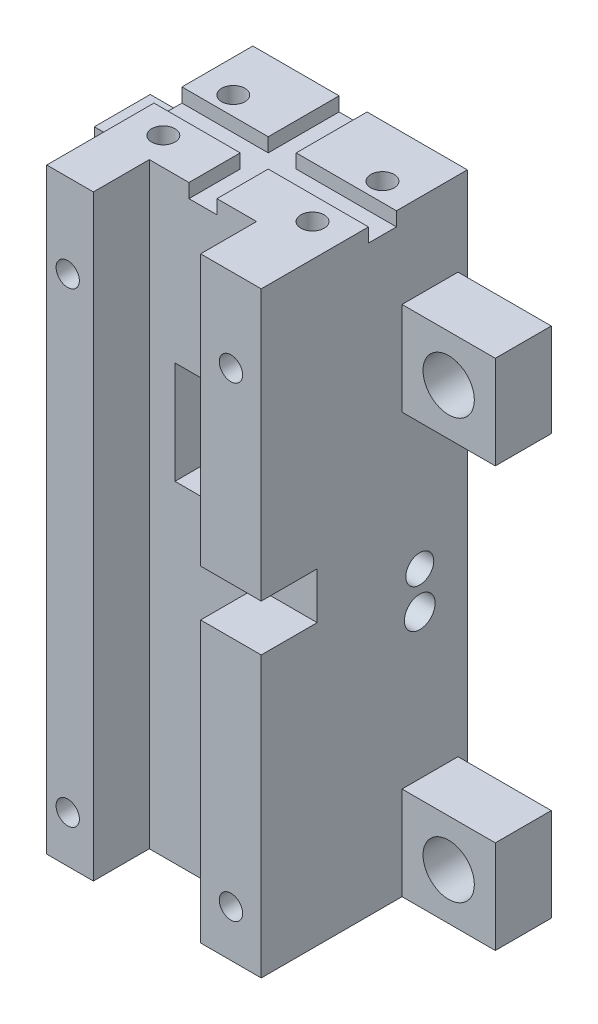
from build123d import *

# Parameters (mm, degrees)
SKETCH_1_W              = 23
SKETCH_1_H              = 70
EXTRUDE_1_DEPTH         = 20.1
SKETCH_2_W              = 6
SKETCH_2_H              = 5
CUT_EXTRUDE_1_DEPTH     = 18
SKETCH_3_W              = 11.5
SKETCH_3_H              = 70
CUT_EXTRUDE_2_DEPTH     = 6
SKETCH_4_W              = 6
SKETCH_4_H              = 3
EXTRUDE_2_DEPTH         = 27
SKETCH_5_W              = 1.5
SKETCH_5_H              = 3
CUT_EXTRUDE_3_DEPTH     = 27
SKETCH_6_R              = 2
CUT_EXTRUDE_4_DEPTH     = 5
SKETCH_11_W             = 50
SKETCH_11_H             = 6
CUT_EXTRUDE_5_DEPTH     = 146.91647042
SKETCH_12_W             = 3
SKETCH_12_H             = 1.5
CUT_EXTRUDE_6_DEPTH     = 121.993547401
SKETCH_14_W             = 3
SKETCH_14_H             = 1.5
CUT_EXTRUDE_7_DEPTH     = 65.507896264
HOLE_WIZARD_M3_2_D      = 2.5
HOLE_WIZARD_M3_2_DEPTH  = 8
HOLE_WIZARD_M3_2_TIP    = 0.751075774
HOLE_WIZARD_M3_3_D      = 2.5
HOLE_WIZARD_M3_3_DEPTH  = 8
HOLE_WIZARD_M3_3_TIP    = 0.751075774
EXTRUDE_3_DEPTH         = 2
SKETCH_21_W             = 6
SKETCH_21_H             = 11
CUT_EXTRUDE_9_DEPTH     = 122.242890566
SKETCH_22_W             = 6
SKETCH_22_H             = 35.5
CUT_EXTRUDE_10_DEPTH    = 10
SKETCH_23_R             = 1.5
CUT_EXTRUDE_11_DEPTH    = 65.507896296
SKETCH_24_R             = 2.4
CUT_EXTRUDE_12_DEPTH    = 2
HOLE_WIZARD_M4_1_REACH  = 66.508
HOLE_WIZARD_M4_1_BORE_R = 1.65
HOLE_WIZARD_M4_2_D      = 3.3
SKETCH_30_W             = 6
SKETCH_30_H             = 10
EXTRUDE_4_DEPTH         = 10
HOLE_WIZARD_5_5_5_5_1_D = 5.5


with BuildPart() as part:
    # Sketch 1 → Extrude 1 (new body)
    with BuildSketch(Plane.XY):
        with Locations((-94.388478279, -21.817767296)):
            Rectangle(SKETCH_1_W, SKETCH_1_H)
    extrude(amount=EXTRUDE_1_DEPTH)

    # Sketch 2 → Cut-Extrude 1 (cut)
    with BuildSketch(Plane(origin=(-82.888478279, 0, 0), x_dir=(0, 0, -1), z_dir=(1, 0, 0))):
        with Locations((-17.1, -24.317767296)):
            Rectangle(SKETCH_2_W, SKETCH_2_H)
    extrude(amount=-CUT_EXTRUDE_1_DEPTH, mode=Mode.SUBTRACT)

    # Sketch 3 → Cut-Extrude 2 (cut)
    with BuildSketch(Plane.XY.offset(20.1)):
        with Locations((-95.138478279, -21.817767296)):
            Rectangle(SKETCH_3_W, SKETCH_3_H)
    extrude(amount=-CUT_EXTRUDE_2_DEPTH, mode=Mode.SUBTRACT)

    # Sketch 4 → Extrude 2 (add)
    with BuildSketch(Plane.ZY.offset(105.888478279)):
        with Locations((17.1, 11.682232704)):
            Rectangle(SKETCH_4_W, SKETCH_4_H)
    extrude(amount=EXTRUDE_2_DEPTH)

    # Sketch 5 → Cut-Extrude 3 (cut)
    with BuildSketch(Plane.ZY.offset(132.888478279)):
        with Locations((19.35, 11.682232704)):
            Rectangle(SKETCH_5_W, SKETCH_5_H)
        with Locations((14.85, 11.682232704)):
            Rectangle(SKETCH_5_W, SKETCH_5_H)
    extrude(amount=-CUT_EXTRUDE_3_DEPTH, mode=Mode.SUBTRACT)

    # Sketch 6 → Cut-Extrude 4 (cut)
    with BuildSketch(Plane.ZY.offset(132.888478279)):
        with Locations((17.1, 9.182232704)):
            Circle(SKETCH_6_R)
    extrude(amount=-CUT_EXTRUDE_4_DEPTH, mode=Mode.SUBTRACT)

    # Sketch 11 → Cut-Extrude 5 (cut, through all)
    with BuildSketch(Plane.XY.offset(20.1)):
        with Locations((-107.888478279, 10.182232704)):
            Rectangle(SKETCH_11_W, SKETCH_11_H)
    extrude(amount=-CUT_EXTRUDE_5_DEPTH, mode=Mode.SUBTRACT)

    # Sketch 12 → Cut-Extrude 6 (cut, through all)
    with BuildSketch(Plane.XY.offset(14.1)):
        with Locations((-95.138478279, 6.432232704)):
            Rectangle(SKETCH_12_W, SKETCH_12_H)
    extrude(amount=-CUT_EXTRUDE_6_DEPTH, mode=Mode.SUBTRACT)

    # Sketch 14 → Cut-Extrude 7 (cut, through all)
    with BuildSketch(Plane(origin=(-82.888478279, 0, 0), x_dir=(0, 0, -1), z_dir=(1, 0, 0))):
        with Locations((-7.1, 6.432232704)):
            Rectangle(SKETCH_14_W, SKETCH_14_H)
    extrude(amount=-CUT_EXTRUDE_7_DEPTH, mode=Mode.SUBTRACT)

    # Hole Wizard M3 _2
    with Locations(Plane(origin=(0, 7.182232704, 0), x_dir=(1, 0, 0), z_dir=(0, 1, 0))):
        with Locations((-86.388478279, -11.1), (-102.388478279, -11.1), (-102.388478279, -3.6), (-86.388478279, -3.6)):
            Hole(HOLE_WIZARD_M3_2_D / 2, depth=HOLE_WIZARD_M3_2_DEPTH)
            with Locations((0, 0, -(HOLE_WIZARD_M3_2_DEPTH + HOLE_WIZARD_M3_2_TIP / 2))):  # 118° drill point
                Cone(0, HOLE_WIZARD_M3_2_D / 2, HOLE_WIZARD_M3_2_TIP, mode=Mode.SUBTRACT)

    # Hole Wizard M3 _3
    with Locations(Plane.XY.offset(20.1)):
        with Locations((-86.138478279, -1.817767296), (-103.638478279, -1.817767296), (-86.138478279, -51.817767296), (-103.638478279, -51.817767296)):
            Hole(HOLE_WIZARD_M3_3_D / 2, depth=HOLE_WIZARD_M3_3_DEPTH)
            with Locations((0, 0, -(HOLE_WIZARD_M3_3_DEPTH + HOLE_WIZARD_M3_3_TIP / 2))):  # 118° drill point
                Cone(0, HOLE_WIZARD_M3_3_D / 2, HOLE_WIZARD_M3_3_TIP, mode=Mode.SUBTRACT)

    # Sketch 19 → Extrude 3 (add)
    with BuildSketch(Plane(origin=(0, 0, 0), x_dir=(-1, 0, 0), z_dir=(0, 0, -1))):
        Polygon((96.638478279, 5.682232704), (93.638478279, 5.682232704), (93.638478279, 7.182232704), (82.888478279, 7.182232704), (82.888478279, -56.817767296), (105.888478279, -56.817767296), (105.888478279, 7.182232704), (96.638478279, 7.182232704), align=None)
    extrude(amount=EXTRUDE_3_DEPTH)

    # Sketch 21 → Cut-Extrude 9 (cut, through all)
    with BuildSketch(Plane.XY.offset(14.1)):
        with Locations((-95.138478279, -15.817767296)):
            Rectangle(SKETCH_21_W, SKETCH_21_H)
    extrude(amount=-CUT_EXTRUDE_9_DEPTH, mode=Mode.SUBTRACT)

    # Sketch 22 → Cut-Extrude 10 (cut)
    with BuildSketch(Plane(origin=(0, 0, -2), x_dir=(-1, 0, 0), z_dir=(0, 0, -1))):
        with Locations((95.138478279, -39.067767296)):
            Rectangle(SKETCH_22_W, SKETCH_22_H)
    extrude(amount=-CUT_EXTRUDE_10_DEPTH, mode=Mode.SUBTRACT)

    # Sketch 23 → Cut-Extrude 11 (cut, through all)
    with BuildSketch(Plane(origin=(-82.888478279, 0, 0), x_dir=(0, 0, -1), z_dir=(1, 0, 0))):
        with Locations((-3.1, -27.317767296)):
            Circle(SKETCH_23_R)
    extrude(amount=-CUT_EXTRUDE_11_DEPTH, mode=Mode.SUBTRACT)

    # Sketch 24 → Cut-Extrude 12 (cut)
    with BuildSketch(Plane(origin=(0, 0, 8), x_dir=(-1, 0, 0), z_dir=(0, 0, -1))):
        with Locations((95.138478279, -33.317767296)):
            Circle(SKETCH_24_R)
    extrude(amount=-CUT_EXTRUDE_12_DEPTH, mode=Mode.SUBTRACT)

    # Hole Wizard M4 _1 bore → Hole Wizard M4 _1 (cut, up to next)
    with BuildSketch(Plane.ZY.offset(105.888478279), mode=Mode.PRIVATE) as hole_wizard_m4_1_sk1:
        with Locations((3.1, -31.317767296)):
            Circle(HOLE_WIZARD_M4_1_BORE_R)
    hole_wizard_m4_1_tool1 = extrude(hole_wizard_m4_1_sk1.sketch, amount=-HOLE_WIZARD_M4_1_REACH, mode=Mode.PRIVATE) & part.part
    add(hole_wizard_m4_1_tool1.solids().sort_by_distance((-105.888478, -31.317767, 3.1))[0], mode=Mode.SUBTRACT)

    # Hole Wizard M4 _2 (through all)
    with Locations(Plane(origin=(-82.888478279, 0, 0), x_dir=(0, 0, -1), z_dir=(1, 0, 0))):
        with Locations((-3.1, -31.317767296)):
            Hole(HOLE_WIZARD_M4_2_D / 2)

    # Sketch 30 → Extrude 4 (add)
    with BuildSketch(Plane.ZY.offset(105.888478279)):
        with Locations((2, -51.817767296)):
            Rectangle(SKETCH_30_W, SKETCH_30_H)
        with Locations((2, -6.817767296)):
            Rectangle(SKETCH_30_W, SKETCH_30_H)
    extrude_4 = extrude(amount=EXTRUDE_4_DEPTH)

    # Mirror 2: Extrude 4 across plane
    add(extrude_4.mirror(Plane.ZY.offset(94.388478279)))

    # Hole Wizard 5.5 _5.5_ _1 (through all)
    with Locations(Plane.XY.offset(5)):
        with Locations((-110.888478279, -6.817767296), (-110.888478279, -51.817767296)):
            hole_wizard_5_5_5_5_1 = Hole(HOLE_WIZARD_5_5_5_5_1_D / 2)

    # Mirror 3: Hole Wizard 5.5 _5.5_ _1 across plane
    add(hole_wizard_5_5_5_5_1.mirror(Plane.ZY.offset(94.388478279)), mode=Mode.SUBTRACT)


solid = part.part
